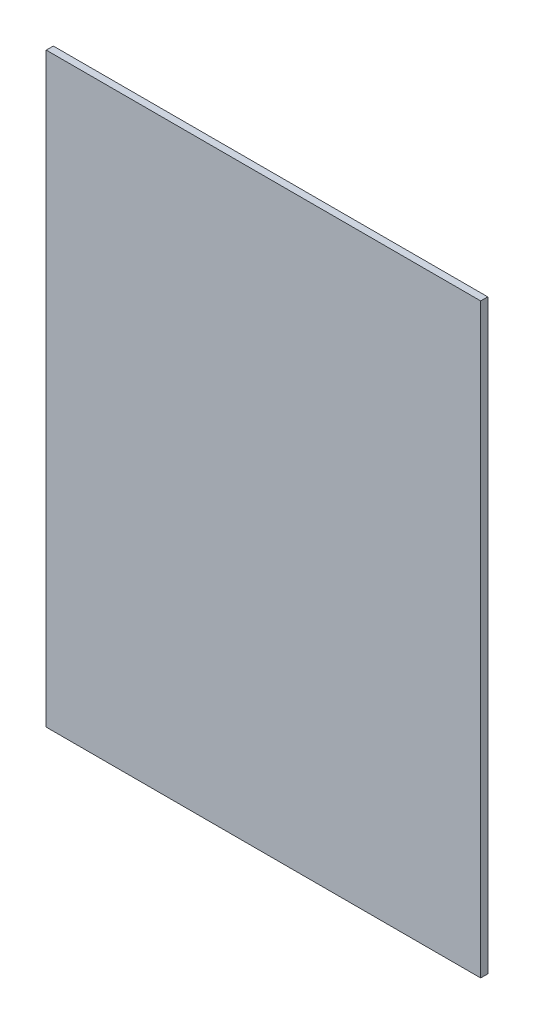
ISO-10303-21;
HEADER;
FILE_DESCRIPTION(('STEP AP214'),'2;1');
FILE_NAME('part.step','',(''),(''),'','','');
FILE_SCHEMA(('AUTOMOTIVE_DESIGN { 1 0 10303 214 1 1 1 1 }'));
ENDSEC;
DATA;
#1=APPLICATION_CONTEXT('core data for automotive mechanical design processes');
#2=APPLICATION_PROTOCOL_DEFINITION('international standard','automotive_design',2000,#1);
#3=PRODUCT_CONTEXT('',#1,'mechanical');
#4=PRODUCT('Part','Part','',(#3));
#5=PRODUCT_RELATED_PRODUCT_CATEGORY('part','',(#4));
#6=PRODUCT_DEFINITION_FORMATION('','',#4);
#7=PRODUCT_DEFINITION_CONTEXT('part definition',#1,'design');
#8=PRODUCT_DEFINITION('design','',#6,#7);
#9=PRODUCT_DEFINITION_SHAPE('','',#8);
#10=(LENGTH_UNIT() NAMED_UNIT(*) SI_UNIT(.MILLI.,.METRE.));
#11=(NAMED_UNIT(*) PLANE_ANGLE_UNIT() SI_UNIT($,.RADIAN.));
#12=(NAMED_UNIT(*) SI_UNIT($,.STERADIAN.) SOLID_ANGLE_UNIT());
#13=UNCERTAINTY_MEASURE_WITH_UNIT(LENGTH_MEASURE(1.E-05),#10,'distance_accuracy_value','');
#14=(GEOMETRIC_REPRESENTATION_CONTEXT(3) GLOBAL_UNCERTAINTY_ASSIGNED_CONTEXT((#13)) GLOBAL_UNIT_ASSIGNED_CONTEXT((#10,
#11,#12)) REPRESENTATION_CONTEXT('',''));
#15=CARTESIAN_POINT('',(0.,0.,0.));
#16=DIRECTION('',(0.,0.,1.));
#17=DIRECTION('',(1.,0.,0.));
#18=AXIS2_PLACEMENT_3D('',#15,#16,#17);
#19=CARTESIAN_POINT('',(0.,0.,10.));
#20=DIRECTION('',(1.,0.,0.));
#21=DIRECTION('',(0.,0.,-1.));
#22=AXIS2_PLACEMENT_3D('',#19,#20,#21);
#23=PLANE('',#22);
#24=DIRECTION('',(0.,-1.,0.));
#25=VECTOR('',#24,1.);
#26=CARTESIAN_POINT('',(0.,0.,0.));
#27=LINE('',#26,#25);
#28=CARTESIAN_POINT('',(0.,830.,0.));
#29=VERTEX_POINT('',#28);
#30=CARTESIAN_POINT('',(0.,0.,0.));
#31=VERTEX_POINT('',#30);
#32=EDGE_CURVE('E81',#29,#31,#27,.T.);
#33=ORIENTED_EDGE('',*,*,#32,.T.);
#34=DIRECTION('',(0.,0.,-1.));
#35=VECTOR('',#34,1.);
#36=CARTESIAN_POINT('',(0.,0.,10.));
#37=LINE('',#36,#35);
#38=CARTESIAN_POINT('',(0.,0.,10.));
#39=VERTEX_POINT('',#38);
#40=EDGE_CURVE('E11',#39,#31,#37,.T.);
#41=ORIENTED_EDGE('',*,*,#40,.F.);
#42=DIRECTION('',(0.,-1.,0.));
#43=VECTOR('',#42,1.);
#44=CARTESIAN_POINT('',(0.,0.,10.));
#45=LINE('',#44,#43);
#46=CARTESIAN_POINT('',(0.,830.,10.));
#47=VERTEX_POINT('',#46);
#48=EDGE_CURVE('E104',#47,#39,#45,.T.);
#49=ORIENTED_EDGE('',*,*,#48,.F.);
#50=DIRECTION('',(0.,0.,-1.));
#51=VECTOR('',#50,1.);
#52=CARTESIAN_POINT('',(0.,830.,10.));
#53=LINE('',#52,#51);
#54=EDGE_CURVE('E94',#47,#29,#53,.T.);
#55=ORIENTED_EDGE('',*,*,#54,.T.);
#56=EDGE_LOOP('',(#33,#41,#49,#55));
#57=FACE_BOUND('',#56,.T.);
#58=ADVANCED_FACE('F36',(#57),#23,.F.);
#59=CARTESIAN_POINT('',(0.,0.,10.));
#60=DIRECTION('',(0.,1.,0.));
#61=DIRECTION('',(0.,0.,1.));
#62=AXIS2_PLACEMENT_3D('',#59,#60,#61);
#63=PLANE('',#62);
#64=DIRECTION('',(1.,0.,0.));
#65=VECTOR('',#64,1.);
#66=CARTESIAN_POINT('',(0.,0.,0.));
#67=LINE('',#66,#65);
#68=CARTESIAN_POINT('',(615.,0.,0.));
#69=VERTEX_POINT('',#68);
#70=EDGE_CURVE('E77',#31,#69,#67,.T.);
#71=ORIENTED_EDGE('',*,*,#70,.T.);
#72=DIRECTION('',(0.,0.,-1.));
#73=VECTOR('',#72,1.);
#74=CARTESIAN_POINT('',(615.,0.,10.));
#75=LINE('',#74,#73);
#76=CARTESIAN_POINT('',(615.,0.,10.));
#77=VERTEX_POINT('',#76);
#78=EDGE_CURVE('E44',#77,#69,#75,.T.);
#79=ORIENTED_EDGE('',*,*,#78,.F.);
#80=DIRECTION('',(1.,0.,0.));
#81=VECTOR('',#80,1.);
#82=CARTESIAN_POINT('',(0.,0.,10.));
#83=LINE('',#82,#81);
#84=EDGE_CURVE('E90',#39,#77,#83,.T.);
#85=ORIENTED_EDGE('',*,*,#84,.F.);
#86=ORIENTED_EDGE('',*,*,#40,.T.);
#87=EDGE_LOOP('',(#71,#79,#85,#86));
#88=FACE_BOUND('',#87,.T.);
#89=ADVANCED_FACE('F89',(#88),#63,.F.);
#90=CARTESIAN_POINT('',(615.,0.,10.));
#91=DIRECTION('',(-1.,0.,0.));
#92=DIRECTION('',(0.,0.,1.));
#93=AXIS2_PLACEMENT_3D('',#90,#91,#92);
#94=PLANE('',#93);
#95=DIRECTION('',(0.,1.,0.));
#96=VECTOR('',#95,1.);
#97=CARTESIAN_POINT('',(615.,0.,0.));
#98=LINE('',#97,#96);
#99=CARTESIAN_POINT('',(615.,830.,0.));
#100=VERTEX_POINT('',#99);
#101=EDGE_CURVE('E82',#69,#100,#98,.T.);
#102=ORIENTED_EDGE('',*,*,#101,.T.);
#103=DIRECTION('',(0.,0.,-1.));
#104=VECTOR('',#103,1.);
#105=CARTESIAN_POINT('',(615.,830.,10.));
#106=LINE('',#105,#104);
#107=CARTESIAN_POINT('',(615.,830.,10.));
#108=VERTEX_POINT('',#107);
#109=EDGE_CURVE('E114',#108,#100,#106,.T.);
#110=ORIENTED_EDGE('',*,*,#109,.F.);
#111=DIRECTION('',(0.,1.,0.));
#112=VECTOR('',#111,1.);
#113=CARTESIAN_POINT('',(615.,0.,10.));
#114=LINE('',#113,#112);
#115=EDGE_CURVE('E56',#77,#108,#114,.T.);
#116=ORIENTED_EDGE('',*,*,#115,.F.);
#117=ORIENTED_EDGE('',*,*,#78,.T.);
#118=EDGE_LOOP('',(#102,#110,#116,#117));
#119=FACE_BOUND('',#118,.T.);
#120=ADVANCED_FACE('F119',(#119),#94,.F.);
#121=CARTESIAN_POINT('',(615.,830.,10.));
#122=DIRECTION('',(0.,-1.,0.));
#123=DIRECTION('',(1.,0.,0.));
#124=AXIS2_PLACEMENT_3D('',#121,#122,#123);
#125=PLANE('',#124);
#126=DIRECTION('',(-1.,0.,0.));
#127=VECTOR('',#126,1.);
#128=CARTESIAN_POINT('',(615.,830.,0.));
#129=LINE('',#128,#127);
#130=EDGE_CURVE('E101',#100,#29,#129,.T.);
#131=ORIENTED_EDGE('',*,*,#130,.T.);
#132=ORIENTED_EDGE('',*,*,#54,.F.);
#133=DIRECTION('',(-1.,0.,0.));
#134=VECTOR('',#133,1.);
#135=CARTESIAN_POINT('',(615.,830.,10.));
#136=LINE('',#135,#134);
#137=EDGE_CURVE('E51',#108,#47,#136,.T.);
#138=ORIENTED_EDGE('',*,*,#137,.F.);
#139=ORIENTED_EDGE('',*,*,#109,.T.);
#140=EDGE_LOOP('',(#131,#132,#138,#139));
#141=FACE_BOUND('',#140,.T.);
#142=ADVANCED_FACE('F121',(#141),#125,.F.);
#143=CARTESIAN_POINT('',(0.,0.,10.));
#144=DIRECTION('',(0.,0.,-1.));
#145=DIRECTION('',(-1.,0.,0.));
#146=AXIS2_PLACEMENT_3D('',#143,#144,#145);
#147=PLANE('',#146);
#148=ORIENTED_EDGE('',*,*,#48,.T.);
#149=ORIENTED_EDGE('',*,*,#84,.T.);
#150=ORIENTED_EDGE('',*,*,#115,.T.);
#151=ORIENTED_EDGE('',*,*,#137,.T.);
#152=EDGE_LOOP('',(#148,#149,#150,#151));
#153=FACE_BOUND('',#152,.T.);
#154=ADVANCED_FACE('F122',(#153),#147,.F.);
#155=CARTESIAN_POINT('',(0.,0.,0.));
#156=DIRECTION('',(0.,0.,-1.));
#157=DIRECTION('',(-1.,0.,0.));
#158=AXIS2_PLACEMENT_3D('',#155,#156,#157);
#159=PLANE('',#158);
#160=ORIENTED_EDGE('',*,*,#32,.F.);
#161=ORIENTED_EDGE('',*,*,#130,.F.);
#162=ORIENTED_EDGE('',*,*,#101,.F.);
#163=ORIENTED_EDGE('',*,*,#70,.F.);
#164=EDGE_LOOP('',(#160,#161,#162,#163));
#165=FACE_BOUND('',#164,.T.);
#166=ADVANCED_FACE('F78',(#165),#159,.T.);
#167=CLOSED_SHELL('',(#58,#89,#120,#142,#154,#166));
#168=MANIFOLD_SOLID_BREP('B2',#167);
#169=ADVANCED_BREP_SHAPE_REPRESENTATION('',(#18,#168),#14);
#170=SHAPE_DEFINITION_REPRESENTATION(#9,#169);
ENDSEC;
END-ISO-10303-21;
